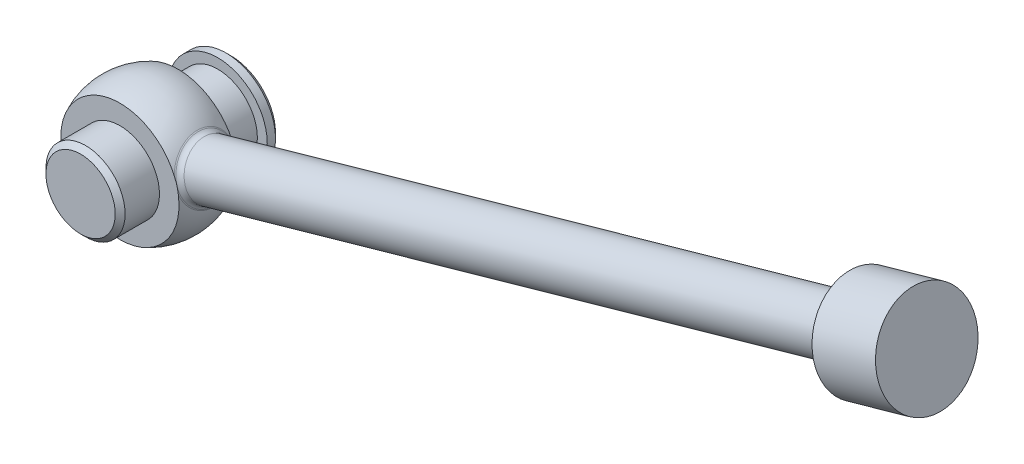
ISO-10303-21;
HEADER;
FILE_DESCRIPTION(('STEP AP214'),'2;1');
FILE_NAME('part.step','',(''),(''),'','','');
FILE_SCHEMA(('AUTOMOTIVE_DESIGN { 1 0 10303 214 1 1 1 1 }'));
ENDSEC;
DATA;
#1=APPLICATION_CONTEXT('core data for automotive mechanical design processes');
#2=APPLICATION_PROTOCOL_DEFINITION('international standard','automotive_design',2000,#1);
#3=PRODUCT_CONTEXT('',#1,'mechanical');
#4=PRODUCT('Part','Part','',(#3));
#5=PRODUCT_RELATED_PRODUCT_CATEGORY('part','',(#4));
#6=PRODUCT_DEFINITION_FORMATION('','',#4);
#7=PRODUCT_DEFINITION_CONTEXT('part definition',#1,'design');
#8=PRODUCT_DEFINITION('design','',#6,#7);
#9=PRODUCT_DEFINITION_SHAPE('','',#8);
#10=(LENGTH_UNIT() NAMED_UNIT(*) SI_UNIT(.MILLI.,.METRE.));
#11=(NAMED_UNIT(*) PLANE_ANGLE_UNIT() SI_UNIT($,.RADIAN.));
#12=(NAMED_UNIT(*) SI_UNIT($,.STERADIAN.) SOLID_ANGLE_UNIT());
#13=UNCERTAINTY_MEASURE_WITH_UNIT(LENGTH_MEASURE(1.E-05),#10,'distance_accuracy_value','');
#14=(GEOMETRIC_REPRESENTATION_CONTEXT(3) GLOBAL_UNCERTAINTY_ASSIGNED_CONTEXT((#13)) GLOBAL_UNIT_ASSIGNED_CONTEXT((#10,
#11,#12)) REPRESENTATION_CONTEXT('',''));
#15=CARTESIAN_POINT('',(0.,0.,0.));
#16=DIRECTION('',(0.,0.,1.));
#17=DIRECTION('',(1.,0.,0.));
#18=AXIS2_PLACEMENT_3D('',#15,#16,#17);
#19=CARTESIAN_POINT('',(142.33000616,-152.5466826,954.379375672));
#20=DIRECTION('',(0.,0.,-1.));
#21=DIRECTION('',(-1.,0.,0.));
#22=AXIS2_PLACEMENT_3D('',#19,#20,#21);
#23=PLANE('',#22);
#24=CARTESIAN_POINT('',(128.122796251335,143.089755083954,954.379375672));
#25=CARTESIAN_POINT('',(128.073408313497,142.728834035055,954.379375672));
#26=CARTESIAN_POINT('',(128.008803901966,142.369928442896,954.379375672));
#27=CARTESIAN_POINT('',(127.849594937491,141.658684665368,954.379375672));
#28=CARTESIAN_POINT('',(127.75497560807,141.306349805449,954.379375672));
#29=CARTESIAN_POINT('',(127.536206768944,140.610225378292,954.379375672));
#30=CARTESIAN_POINT('',(127.412001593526,140.266453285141,954.379375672));
#31=CARTESIAN_POINT('',(127.135042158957,139.590608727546,954.379375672));
#32=CARTESIAN_POINT('',(126.982287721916,139.258536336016,954.379375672));
#33=CARTESIAN_POINT('',(126.649460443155,138.608733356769,954.379375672));
#34=CARTESIAN_POINT('',(126.469411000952,138.29099078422,954.379375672));
#35=CARTESIAN_POINT('',(126.083173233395,137.671797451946,954.379375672));
#36=CARTESIAN_POINT('',(125.876984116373,137.370347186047,954.379375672));
#37=CARTESIAN_POINT('',(125.440044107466,136.786034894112,954.379375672));
#38=CARTESIAN_POINT('',(125.209305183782,136.50316391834,954.379375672));
#39=CARTESIAN_POINT('',(124.724824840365,135.957862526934,954.379375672));
#40=CARTESIAN_POINT('',(124.471083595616,135.695431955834,954.379375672));
#41=CARTESIAN_POINT('',(123.942348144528,135.192824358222,954.379375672));
#42=CARTESIAN_POINT('',(123.667349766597,134.952651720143,954.379375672));
#43=CARTESIAN_POINT('',(123.098098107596,134.496325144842,954.379375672));
#44=CARTESIAN_POINT('',(122.803844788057,134.280171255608,954.379375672));
#45=CARTESIAN_POINT('',(122.198149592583,133.873401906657,954.379375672));
#46=CARTESIAN_POINT('',(121.886706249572,133.682788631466,954.379375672));
#47=CARTESIAN_POINT('',(121.248868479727,133.328477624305,954.379375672));
#48=CARTESIAN_POINT('',(120.922474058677,133.164779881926,954.379375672));
#49=CARTESIAN_POINT('',(120.257067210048,132.865469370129,954.379375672));
#50=CARTESIAN_POINT('',(119.918055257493,132.729855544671,954.379375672));
#51=CARTESIAN_POINT('',(119.229811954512,132.487669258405,954.379375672));
#52=CARTESIAN_POINT('',(118.880580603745,132.381096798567,954.379375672));
#53=CARTESIAN_POINT('',(118.174385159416,132.197751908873,954.379375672));
#54=CARTESIAN_POINT('',(117.817421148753,132.120979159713,954.379375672));
#55=CARTESIAN_POINT('',(117.098294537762,131.997777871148,954.379375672));
#56=CARTESIAN_POINT('',(116.736131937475,131.951349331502,954.379375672));
#57=CARTESIAN_POINT('',(116.009180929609,131.88916637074,954.379375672));
#58=CARTESIAN_POINT('',(115.644392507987,131.873412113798,954.379375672));
#59=CARTESIAN_POINT('',(114.914785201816,131.872690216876,954.379375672));
#60=CARTESIAN_POINT('',(114.549966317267,131.887722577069,954.379375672));
#61=CARTESIAN_POINT('',(113.822891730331,131.948467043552,954.379375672));
#62=CARTESIAN_POINT('',(113.460636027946,131.994179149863,954.379375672));
#63=CARTESIAN_POINT('',(112.741263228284,132.115958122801,954.379375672));
#64=CARTESIAN_POINT('',(112.384146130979,132.192024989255,954.379375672));
#65=CARTESIAN_POINT('',(111.677591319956,132.37397220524,954.379375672));
#66=CARTESIAN_POINT('',(111.328153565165,132.479852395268,954.379375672));
#67=CARTESIAN_POINT('',(110.639439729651,132.72067368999,954.379375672));
#68=CARTESIAN_POINT('',(110.300163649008,132.855614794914,954.379375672));
#69=CARTESIAN_POINT('',(109.634181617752,133.153600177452,954.379375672));
#70=CARTESIAN_POINT('',(109.307475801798,133.316644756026,954.379375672));
#71=CARTESIAN_POINT('',(108.668960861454,133.669676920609,954.379375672));
#72=CARTESIAN_POINT('',(108.357151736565,133.85966450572,954.379375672));
#73=CARTESIAN_POINT('',(107.750635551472,134.265239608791,954.379375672));
#74=CARTESIAN_POINT('',(107.455929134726,134.480828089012,954.379375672));
#75=CARTESIAN_POINT('',(106.885726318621,134.936066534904,954.379375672));
#76=CARTESIAN_POINT('',(106.610229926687,135.175716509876,954.379375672));
#77=CARTESIAN_POINT('',(106.080428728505,135.677352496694,954.379375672));
#78=CARTESIAN_POINT('',(105.826122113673,135.939336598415,954.379375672));
#79=CARTESIAN_POINT('',(105.340482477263,136.483795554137,954.379375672));
#80=CARTESIAN_POINT('',(105.109149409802,136.766270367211,954.379375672));
#81=CARTESIAN_POINT('',(104.671143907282,137.349645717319,954.379375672));
#82=CARTESIAN_POINT('',(104.464466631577,137.650542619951,954.379375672));
#83=CARTESIAN_POINT('',(104.077187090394,138.268676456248,954.379375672));
#84=CARTESIAN_POINT('',(103.896585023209,138.585913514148,954.379375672));
#85=CARTESIAN_POINT('',(103.562660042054,139.234628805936,954.379375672));
#86=CARTESIAN_POINT('',(103.409350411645,139.566113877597,954.379375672));
#87=CARTESIAN_POINT('',(103.13121275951,140.24081334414,954.379375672));
#88=CARTESIAN_POINT('',(103.00638387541,140.584027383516,954.379375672));
#89=CARTESIAN_POINT('',(102.785995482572,141.280049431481,954.379375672));
#90=CARTESIAN_POINT('',(102.69046103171,141.632865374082,954.379375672));
#91=CARTESIAN_POINT('',(102.529487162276,142.345297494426,954.379375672));
#92=CARTESIAN_POINT('',(102.46404755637,142.704913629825,954.379375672));
#93=CARTESIAN_POINT('',(102.363822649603,143.42768881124,954.379375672));
#94=CARTESIAN_POINT('',(102.328979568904,143.790839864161,954.379375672));
#95=CARTESIAN_POINT('',(102.289997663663,144.518641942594,954.379375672));
#96=CARTESIAN_POINT('',(102.285843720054,144.883292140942,954.379375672));
#97=CARTESIAN_POINT('',(102.304023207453,145.475046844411,954.379375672));
#98=CARTESIAN_POINT('',(102.317012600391,145.702478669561,954.379375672));
#99=CARTESIAN_POINT('',(102.354938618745,146.156343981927,954.379375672));
#100=CARTESIAN_POINT('',(102.37987524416,146.382777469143,954.379375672));
#101=CARTESIAN_POINT('',(102.460158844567,146.9693426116,954.379375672));
#102=CARTESIAN_POINT('',(102.524774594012,147.328246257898,954.379375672));
#103=CARTESIAN_POINT('',(102.684006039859,148.039485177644,954.379375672));
#104=CARTESIAN_POINT('',(102.778636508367,148.391817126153,954.379375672));
#105=CARTESIAN_POINT('',(102.997427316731,149.087934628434,954.379375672));
#106=CARTESIAN_POINT('',(103.121643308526,149.431702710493,954.379375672));
#107=CARTESIAN_POINT('',(103.398623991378,150.107538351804,954.379375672));
#108=CARTESIAN_POINT('',(103.551388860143,150.439605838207,954.379375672));
#109=CARTESIAN_POINT('',(103.88423656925,151.089398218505,954.379375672));
#110=CARTESIAN_POINT('',(104.064296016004,151.407135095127,954.379375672));
#111=CARTESIAN_POINT('',(104.450553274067,152.026316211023,954.379375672));
#112=CARTESIAN_POINT('',(104.656751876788,152.327759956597,954.379375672));
#113=CARTESIAN_POINT('',(105.093710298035,152.912058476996,954.379375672));
#114=CARTESIAN_POINT('',(105.324458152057,153.194922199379,954.379375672));
#115=CARTESIAN_POINT('',(105.808955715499,153.740208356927,954.379375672));
#116=CARTESIAN_POINT('',(106.062705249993,154.002630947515,954.379375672));
#117=CARTESIAN_POINT('',(106.591456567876,154.50522189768,954.379375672));
#118=CARTESIAN_POINT('',(106.866462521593,154.745385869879,954.379375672));
#119=CARTESIAN_POINT('',(107.435728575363,155.201694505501,954.379375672));
#120=CARTESIAN_POINT('',(107.72998871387,155.41783912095,954.379375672));
#121=CARTESIAN_POINT('',(108.335696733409,155.824589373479,954.379375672));
#122=CARTESIAN_POINT('',(108.647146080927,156.015192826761,954.379375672));
#123=CARTESIAN_POINT('',(109.284995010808,156.369483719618,954.379375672));
#124=CARTESIAN_POINT('',(109.611394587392,156.533171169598,954.379375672));
#125=CARTESIAN_POINT('',(110.276810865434,156.832460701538,954.379375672));
#126=CARTESIAN_POINT('',(110.615827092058,156.968063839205,954.379375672));
#127=CARTESIAN_POINT('',(111.304078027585,157.210228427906,954.379375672));
#128=CARTESIAN_POINT('',(111.653312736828,157.316789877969,954.379375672));
#129=CARTESIAN_POINT('',(112.359513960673,157.50011250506,954.379375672));
#130=CARTESIAN_POINT('',(112.71648039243,157.576874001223,954.379375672));
#131=CARTESIAN_POINT('',(113.435610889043,157.700052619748,954.379375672));
#132=CARTESIAN_POINT('',(113.797774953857,157.746469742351,954.379375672));
#133=CARTESIAN_POINT('',(114.524727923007,157.808629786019,954.379375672));
#134=CARTESIAN_POINT('',(114.889516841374,157.824372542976,954.379375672));
#135=CARTESIAN_POINT('',(115.619124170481,157.825071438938,954.379375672));
#136=CARTESIAN_POINT('',(115.983942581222,157.810027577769,954.379375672));
#137=CARTESIAN_POINT('',(116.711015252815,157.749260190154,954.379375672));
#138=CARTESIAN_POINT('',(117.073269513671,157.703536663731,954.379375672));
#139=CARTESIAN_POINT('',(117.792638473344,157.581735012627,954.379375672));
#140=CARTESIAN_POINT('',(118.149753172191,157.505656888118,954.379375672));
#141=CARTESIAN_POINT('',(118.85630224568,157.32368739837,954.379375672));
#142=CARTESIAN_POINT('',(119.205736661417,157.217796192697,954.379375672));
#143=CARTESIAN_POINT('',(119.894442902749,156.976953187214,954.379375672));
#144=CARTESIAN_POINT('',(120.233714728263,156.842001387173,954.379375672));
#145=CARTESIAN_POINT('',(120.899687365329,156.543995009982,954.379375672));
#146=CARTESIAN_POINT('',(121.226388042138,156.380940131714,954.379375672));
#147=CARTESIAN_POINT('',(121.864891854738,156.027887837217,954.379375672));
#148=CARTESIAN_POINT('',(122.176694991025,155.837890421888,954.379375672));
#149=CARTESIAN_POINT('',(122.783198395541,155.432296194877,954.379375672));
#150=CARTESIAN_POINT('',(123.077898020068,155.216698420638,954.379375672));
#151=CARTESIAN_POINT('',(123.648086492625,154.76144199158,954.379375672));
#152=CARTESIAN_POINT('',(123.923575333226,154.521783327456,954.379375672));
#153=CARTESIAN_POINT('',(124.453360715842,154.020130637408,954.379375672));
#154=CARTESIAN_POINT('',(124.707659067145,153.758138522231,954.379375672));
#155=CARTESIAN_POINT('',(125.193281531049,153.213664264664,954.379375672));
#156=CARTESIAN_POINT('',(125.42460568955,152.931182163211,954.379375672));
#157=CARTESIAN_POINT('',(125.862592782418,152.347793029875,954.379375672));
#158=CARTESIAN_POINT('',(126.069260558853,152.046889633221,954.379375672));
#159=CARTESIAN_POINT('',(126.45652059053,151.428743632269,954.379375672));
#160=CARTESIAN_POINT('',(126.637112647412,151.111500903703,954.379375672));
#161=CARTESIAN_POINT('',(126.971017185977,150.462775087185,954.379375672));
#162=CARTESIAN_POINT('',(127.124316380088,150.131285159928,954.379375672));
#163=CARTESIAN_POINT('',(127.402432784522,149.456576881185,954.379375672));
#164=CARTESIAN_POINT('',(127.527250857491,149.113358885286,954.379375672));
#165=CARTESIAN_POINT('',(127.747617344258,148.4173297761,954.379375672));
#166=CARTESIAN_POINT('',(127.843140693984,148.064510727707,954.379375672));
#167=CARTESIAN_POINT('',(128.00409213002,147.352073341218,954.379375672));
#168=CARTESIAN_POINT('',(128.069520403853,146.992455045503,954.379375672));
#169=CARTESIAN_POINT('',(128.16972249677,146.269676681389,954.379375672));
#170=CARTESIAN_POINT('',(128.204554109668,145.906524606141,954.379375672));
#171=CARTESIAN_POINT('',(128.243513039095,145.178721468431,954.379375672));
#172=CARTESIAN_POINT('',(128.247655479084,144.814071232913,954.379375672));
#173=CARTESIAN_POINT('',(128.229461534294,144.222453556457,954.379375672));
#174=CARTESIAN_POINT('',(128.216476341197,143.995158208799,954.379375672));
#175=CARTESIAN_POINT('',(128.178573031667,143.541564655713,954.379375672));
#176=CARTESIAN_POINT('',(128.153654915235,143.315266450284,954.379375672));
#177=CARTESIAN_POINT('',(128.122796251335,143.089755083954,954.379375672));
#178=B_SPLINE_CURVE_WITH_KNOTS('',3,(#24,#25,#26,#27,#28,#29,#30,#31,#32,#33,#34,#35,#36,#37,
#38,#39,#40,#41,#42,#43,#44,#45,#46,#47,#48,#49,#50,#51,#52,#53,#54,#55,#56,#57,#58,#59,#60,#61,
#62,#63,#64,#65,#66,#67,#68,#69,#70,#71,#72,#73,#74,#75,#76,#77,#78,#79,#80,#81,#82,#83,#84,#85,
#86,#87,#88,#89,#90,#91,#92,#93,#94,#95,#96,#97,#98,#99,#100,#101,#102,#103,#104,#105,#106,#107,
#108,#109,#110,#111,#112,#113,#114,#115,#116,#117,#118,#119,#120,#121,#122,#123,#124,#125,#126,
#127,#128,#129,#130,#131,#132,#133,#134,#135,#136,#137,#138,#139,#140,#141,#142,#143,#144,#145,
#146,#147,#148,#149,#150,#151,#152,#153,#154,#155,#156,#157,#158,#159,#160,#161,#162,#163,#164,
#165,#166,#167,#168,#169,#170,#171,#172,#173,#174,#175,#176,#177),.UNSPECIFIED.,.T.,.F.,(4,2,2,
2,2,2,2,2,2,2,2,2,2,2,2,2,2,2,2,2,2,2,2,2,2,2,2,2,2,2,2,2,2,2,2,2,2,2,2,2,2,2,2,2,2,2,2,2,2,2,2,
2,2,2,2,2,2,2,2,2,2,2,2,2,2,2,2,2,2,2,2,2,2,2,2,2,4),(0.,1.09264502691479,2.18582880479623,
3.28108588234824,4.37634978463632,5.47067999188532,6.565043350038,7.65887562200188,
8.75269957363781,9.84673872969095,10.9407800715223,12.0349149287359,13.129049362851,
14.2231426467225,15.3172359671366,16.411317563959,17.5053991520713,18.5994865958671,
19.6935740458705,20.7876614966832,21.8817489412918,22.9758305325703,24.0699121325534,
25.1640054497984,26.2580987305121,27.3522331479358,28.4463679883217,29.5404093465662,
30.6344485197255,31.7282725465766,32.8221048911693,33.9164681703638,35.0107983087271,
36.1060619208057,37.2013187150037,38.2945027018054,39.3871480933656,40.0702655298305,
40.7533829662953,41.8460283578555,42.9392123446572,44.0344691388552,45.1297327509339,
46.2240628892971,47.3184261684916,48.4122585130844,49.5060825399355,50.6001217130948,
51.6941630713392,52.788297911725,53.8824323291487,54.9765256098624,56.0706189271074,
57.1647005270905,58.258782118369,59.3528695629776,60.4469570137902,61.5410444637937,
62.6351319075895,63.7292134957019,64.8232950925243,65.9173884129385,67.0114816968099,
68.105616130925,69.1997509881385,70.29379232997,71.3878314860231,72.481655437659,
73.5754877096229,74.6698510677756,75.7641812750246,76.8594451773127,77.9547022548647,
79.0478860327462,80.140531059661,80.8232395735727,81.5059480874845),.UNSPECIFIED.);
#179=CARTESIAN_POINT('',(126.946109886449,150.502647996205,954.379375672));
#180=VERTEX_POINT('',#179);
#181=CARTESIAN_POINT('',(128.175793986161,146.163820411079,954.379375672));
#182=VERTEX_POINT('',#181);
#183=EDGE_CURVE('E65',#180,#182,#178,.T.);
#184=ORIENTED_EDGE('',*,*,#183,.F.);
#185=CARTESIAN_POINT('',(110.456218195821,143.485514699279,954.379375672));
#186=DIRECTION('',(0.,0.,1.));
#187=DIRECTION('',(1.,0.,0.));
#188=AXIS2_PLACEMENT_3D('',#185,#186,#187);
#189=CIRCLE('',#188,17.9208450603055);
#190=EDGE_CURVE('E93',#180,#182,#189,.T.);
#191=ORIENTED_EDGE('',*,*,#190,.T.);
#192=EDGE_LOOP('',(#184,#191));
#193=FACE_BOUND('',#192,.T.);
#194=CARTESIAN_POINT('',(110.456218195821,143.485514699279,954.379375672));
#195=DIRECTION('',(0.,0.,1.));
#196=DIRECTION('',(1.,0.,0.));
#197=AXIS2_PLACEMENT_3D('',#194,#195,#196);
#198=CIRCLE('',#197,12.);
#199=CARTESIAN_POINT('',(122.456218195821,143.485514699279,954.379375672));
#200=VERTEX_POINT('',#199);
#201=EDGE_CURVE('E96',#200,#200,#198,.T.);
#202=ORIENTED_EDGE('',*,*,#201,.F.);
#203=EDGE_LOOP('',(#202));
#204=FACE_BOUND('',#203,.T.);
#205=ADVANCED_FACE('F39',(#193,#204),#23,.F.);
#206=CARTESIAN_POINT('',(154.071282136,-155.874323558,936.704162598));
#207=DIRECTION('',(0.,0.,-1.));
#208=DIRECTION('',(-1.,0.,0.));
#209=AXIS2_PLACEMENT_3D('',#206,#207,#208);
#210=PLANE('',#209);
#211=CARTESIAN_POINT('',(127.440733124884,149.501107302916,936.704162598));
#212=CARTESIAN_POINT('',(127.309924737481,149.843518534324,936.704162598));
#213=CARTESIAN_POINT('',(127.164601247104,150.180376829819,936.704162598));
#214=CARTESIAN_POINT('',(126.846121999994,150.840650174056,936.704162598));
#215=CARTESIAN_POINT('',(126.672967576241,151.164065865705,936.704162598));
#216=CARTESIAN_POINT('',(126.30014278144,151.794927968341,936.704162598));
#217=CARTESIAN_POINT('',(126.100491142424,152.102385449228,936.704162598));
#218=CARTESIAN_POINT('',(125.676010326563,152.699392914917,936.704162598));
#219=CARTESIAN_POINT('',(125.45118145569,152.988943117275,936.704162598));
#220=CARTESIAN_POINT('',(124.977826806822,153.548213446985,936.704162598));
#221=CARTESIAN_POINT('',(124.729289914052,153.817924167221,936.704162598));
#222=CARTESIAN_POINT('',(124.210376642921,154.33544740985,936.704162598));
#223=CARTESIAN_POINT('',(123.940000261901,154.583259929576,936.704162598));
#224=CARTESIAN_POINT('',(123.379384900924,155.05517865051,936.704162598));
#225=CARTESIAN_POINT('',(123.08914978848,155.27928944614,936.704162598));
#226=CARTESIAN_POINT('',(122.490834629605,155.70226586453,936.704162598));
#227=CARTESIAN_POINT('',(122.182754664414,155.901131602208,936.704162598));
#228=CARTESIAN_POINT('',(121.550930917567,156.272209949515,936.704162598));
#229=CARTESIAN_POINT('',(121.227186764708,156.44442192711,936.704162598));
#230=CARTESIAN_POINT('',(120.566342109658,156.760963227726,936.704162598));
#231=CARTESIAN_POINT('',(120.22924158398,156.905292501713,936.704162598));
#232=CARTESIAN_POINT('',(119.544029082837,157.165061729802,936.704162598));
#233=CARTESIAN_POINT('',(119.19591545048,157.280497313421,936.704162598));
#234=CARTESIAN_POINT('',(118.491200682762,157.481629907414,936.704162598));
#235=CARTESIAN_POINT('',(118.134599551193,157.567326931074,936.704162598));
#236=CARTESIAN_POINT('',(117.415461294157,157.708369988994,936.704162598));
#237=CARTESIAN_POINT('',(117.052924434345,157.763717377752,936.704162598));
#238=CARTESIAN_POINT('',(116.324476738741,157.843673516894,936.704162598));
#239=CARTESIAN_POINT('',(115.958565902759,157.868282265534,936.704162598));
#240=CARTESIAN_POINT('',(115.225994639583,157.886585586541,936.704162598));
#241=CARTESIAN_POINT('',(114.859334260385,157.880282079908,936.704162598));
#242=CARTESIAN_POINT('',(114.127847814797,157.836810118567,936.704162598));
#243=CARTESIAN_POINT('',(113.763021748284,157.799641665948,936.704162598));
#244=CARTESIAN_POINT('',(113.037789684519,157.694702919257,936.704162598));
#245=CARTESIAN_POINT('',(112.677383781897,157.626931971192,936.704162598));
#246=CARTESIAN_POINT('',(111.963562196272,157.461269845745,936.704162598));
#247=CARTESIAN_POINT('',(111.610146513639,157.363378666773,936.704162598));
#248=CARTESIAN_POINT('',(110.91281113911,157.138169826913,936.704162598));
#249=CARTESIAN_POINT('',(110.568891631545,157.01085159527,936.704162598));
#250=CARTESIAN_POINT('',(109.893000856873,156.727694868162,936.704162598));
#251=CARTESIAN_POINT('',(109.561029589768,156.571856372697,936.704162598));
#252=CARTESIAN_POINT('',(108.911397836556,156.232768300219,936.704162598));
#253=CARTESIAN_POINT('',(108.593737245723,156.049518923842,936.704162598));
#254=CARTESIAN_POINT('',(107.9749826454,155.656911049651,936.704162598));
#255=CARTESIAN_POINT('',(107.673888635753,155.447552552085,936.704162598));
#256=CARTESIAN_POINT('',(107.090409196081,155.004215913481,936.704162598));
#257=CARTESIAN_POINT('',(106.808023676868,154.770237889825,936.704162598));
#258=CARTESIAN_POINT('',(106.263967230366,154.279324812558,936.704162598));
#259=CARTESIAN_POINT('',(106.00229630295,154.022389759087,936.704162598));
#260=CARTESIAN_POINT('',(105.501530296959,153.487390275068,936.704162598));
#261=CARTESIAN_POINT('',(105.262435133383,153.209325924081,936.704162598));
#262=CARTESIAN_POINT('',(104.808519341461,152.634043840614,936.704162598));
#263=CARTESIAN_POINT('',(104.593698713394,152.336826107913,936.704162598));
#264=CARTESIAN_POINT('',(104.189856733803,151.725346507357,936.704162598));
#265=CARTESIAN_POINT('',(104.000835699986,151.411084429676,936.704162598));
#266=CARTESIAN_POINT('',(103.649939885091,150.767753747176,936.704162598));
#267=CARTESIAN_POINT('',(103.488065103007,150.438685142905,936.704162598));
#268=CARTESIAN_POINT('',(103.192606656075,149.768067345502,936.704162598));
#269=CARTESIAN_POINT('',(103.059024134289,149.426517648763,936.704162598));
#270=CARTESIAN_POINT('',(102.821108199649,148.733378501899,936.704162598));
#271=CARTESIAN_POINT('',(102.716774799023,148.381789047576,936.704162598));
#272=CARTESIAN_POINT('',(102.538107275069,147.671103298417,936.704162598));
#273=CARTESIAN_POINT('',(102.463770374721,147.312007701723,936.704162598));
#274=CARTESIAN_POINT('',(102.345610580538,146.588831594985,936.704162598));
#275=CARTESIAN_POINT('',(102.301787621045,146.224751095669,936.704162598));
#276=CARTESIAN_POINT('',(102.244972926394,145.494269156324,936.704162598));
#277=CARTESIAN_POINT('',(102.231974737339,145.127868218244,936.704162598));
#278=CARTESIAN_POINT('',(102.236883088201,144.395270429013,936.704162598));
#279=CARTESIAN_POINT('',(102.254789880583,144.029073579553,936.704162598));
#280=CARTESIAN_POINT('',(102.321398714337,143.299299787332,936.704162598));
#281=CARTESIAN_POINT('',(102.370116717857,142.935724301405,936.704162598));
#282=CARTESIAN_POINT('',(102.498014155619,142.213983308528,936.704162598));
#283=CARTESIAN_POINT('',(102.57719260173,141.855817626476,936.704162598));
#284=CARTESIAN_POINT('',(102.765532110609,141.147113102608,936.704162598));
#285=CARTESIAN_POINT('',(102.874720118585,140.796581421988,936.704162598));
#286=CARTESIAN_POINT('',(103.122271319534,140.105975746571,936.704162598));
#287=CARTESIAN_POINT('',(103.260634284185,139.765901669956,936.704162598));
#288=CARTESIAN_POINT('',(103.565235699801,139.099311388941,936.704162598));
#289=CARTESIAN_POINT('',(103.731417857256,138.772769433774,936.704162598));
#290=CARTESIAN_POINT('',(104.090609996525,138.134964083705,936.704162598));
#291=CARTESIAN_POINT('',(104.283605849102,137.823692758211,936.704162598));
#292=CARTESIAN_POINT('',(104.599399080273,137.359225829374,936.704162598));
#293=CARTESIAN_POINT('',(104.713134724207,137.199797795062,936.704162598));
#294=CARTESIAN_POINT('',(104.947671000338,136.886226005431,936.704162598));
#295=CARTESIAN_POINT('',(105.06847163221,136.732082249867,936.704162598));
#296=CARTESIAN_POINT('',(105.424821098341,136.297906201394,936.704162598));
#297=CARTESIAN_POINT('',(105.668910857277,136.024807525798,936.704162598));
#298=CARTESIAN_POINT('',(106.179258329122,135.500059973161,936.704162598));
#299=CARTESIAN_POINT('',(106.445523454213,135.248418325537,936.704162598));
#300=CARTESIAN_POINT('',(106.998765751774,134.768019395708,936.704162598));
#301=CARTESIAN_POINT('',(107.285777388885,134.539301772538,936.704162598));
#302=CARTESIAN_POINT('',(107.878296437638,134.106705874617,936.704162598));
#303=CARTESIAN_POINT('',(108.183818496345,133.902847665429,936.704162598));
#304=CARTESIAN_POINT('',(108.810414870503,133.521974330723,936.704162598));
#305=CARTESIAN_POINT('',(109.131460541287,133.344912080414,936.704162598));
#306=CARTESIAN_POINT('',(109.787472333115,133.018381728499,936.704162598));
#307=CARTESIAN_POINT('',(110.12244469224,132.8689261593,936.704162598));
#308=CARTESIAN_POINT('',(110.803805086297,132.598765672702,936.704162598));
#309=CARTESIAN_POINT('',(111.150193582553,132.478061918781,936.704162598));
#310=CARTESIAN_POINT('',(111.85175090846,132.26631925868,936.704162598));
#311=CARTESIAN_POINT('',(112.206915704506,132.17526698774,936.704162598));
#312=CARTESIAN_POINT('',(112.923881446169,132.023351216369,936.704162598));
#313=CARTESIAN_POINT('',(113.285686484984,131.962507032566,936.704162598));
#314=CARTESIAN_POINT('',(114.012785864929,131.871571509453,936.704162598));
#315=CARTESIAN_POINT('',(114.378076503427,131.84145056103,936.704162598));
#316=CARTESIAN_POINT('',(115.11006731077,131.812065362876,936.704162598));
#317=CARTESIAN_POINT('',(115.476768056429,131.81281547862,936.704162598));
#318=CARTESIAN_POINT('',(116.208887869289,131.845206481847,936.704162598));
#319=CARTESIAN_POINT('',(116.574306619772,131.876854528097,936.704162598));
#320=CARTESIAN_POINT('',(117.301123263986,131.970819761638,936.704162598));
#321=CARTESIAN_POINT('',(117.662521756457,132.033132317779,936.704162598));
#322=CARTESIAN_POINT('',(118.378784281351,132.187981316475,936.704162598));
#323=CARTESIAN_POINT('',(118.733648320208,132.280517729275,936.704162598));
#324=CARTESIAN_POINT('',(119.434307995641,132.495153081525,936.704162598));
#325=CARTESIAN_POINT('',(119.78010392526,132.617251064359,936.704162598));
#326=CARTESIAN_POINT('',(120.46018488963,132.890144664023,936.704162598));
#327=CARTESIAN_POINT('',(120.794469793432,133.04094060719,936.704162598));
#328=CARTESIAN_POINT('',(121.44914435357,133.370155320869,936.704162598));
#329=CARTESIAN_POINT('',(121.769534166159,133.548573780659,936.704162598));
#330=CARTESIAN_POINT('',(122.394144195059,133.93176595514,936.704162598));
#331=CARTESIAN_POINT('',(122.698364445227,134.136539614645,936.704162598));
#332=CARTESIAN_POINT('',(123.288485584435,134.570995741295,936.704162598));
#333=CARTESIAN_POINT('',(123.574385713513,134.800679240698,936.704162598));
#334=CARTESIAN_POINT('',(124.125820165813,135.283315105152,936.704162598));
#335=CARTESIAN_POINT('',(124.391354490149,135.536267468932,936.704162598));
#336=CARTESIAN_POINT('',(124.900172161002,136.063645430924,936.704162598));
#337=CARTESIAN_POINT('',(125.143455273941,136.338071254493,936.704162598));
#338=CARTESIAN_POINT('',(125.606038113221,136.906443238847,936.704162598));
#339=CARTESIAN_POINT('',(125.825337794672,137.200389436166,936.704162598));
#340=CARTESIAN_POINT('',(126.238381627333,137.805693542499,936.704162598));
#341=CARTESIAN_POINT('',(126.432127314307,138.117050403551,936.704162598));
#342=CARTESIAN_POINT('',(126.792699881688,138.754976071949,936.704162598));
#343=CARTESIAN_POINT('',(126.959526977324,139.081544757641,936.704162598));
#344=CARTESIAN_POINT('',(127.265090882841,139.74760192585,936.704162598));
#345=CARTESIAN_POINT('',(127.403825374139,140.087091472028,936.704162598));
#346=CARTESIAN_POINT('',(127.652204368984,140.776563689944,936.704162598));
#347=CARTESIAN_POINT('',(127.761847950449,141.126546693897,936.704162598));
#348=CARTESIAN_POINT('',(127.95125197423,141.834472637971,936.704162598));
#349=CARTESIAN_POINT('',(128.031014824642,142.192414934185,936.704162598));
#350=CARTESIAN_POINT('',(128.16009534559,142.913719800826,936.704162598));
#351=CARTESIAN_POINT('',(128.209416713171,143.277081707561,936.704162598));
#352=CARTESIAN_POINT('',(128.271531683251,143.944836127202,936.704162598));
#353=CARTESIAN_POINT('',(128.289096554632,144.248794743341,936.704162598));
#354=CARTESIAN_POINT('',(128.302911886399,144.857169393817,936.704162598));
#355=CARTESIAN_POINT('',(128.299165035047,145.16158536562,936.704162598));
#356=CARTESIAN_POINT('',(128.270382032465,145.769213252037,936.704162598));
#357=CARTESIAN_POINT('',(128.245359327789,146.072425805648,936.704162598));
#358=CARTESIAN_POINT('',(128.17418213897,146.676405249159,936.704162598));
#359=CARTESIAN_POINT('',(128.12802455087,146.977171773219,936.704162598));
#360=CARTESIAN_POINT('',(128.0713730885,147.275953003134,936.704162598));
#361=B_SPLINE_CURVE_WITH_KNOTS('',3,(#211,#212,#213,#214,#215,#216,#217,#218,#219,#220,#221,
#222,#223,#224,#225,#226,#227,#228,#229,#230,#231,#232,#233,#234,#235,#236,#237,#238,#239,#240,
#241,#242,#243,#244,#245,#246,#247,#248,#249,#250,#251,#252,#253,#254,#255,#256,#257,#258,#259,
#260,#261,#262,#263,#264,#265,#266,#267,#268,#269,#270,#271,#272,#273,#274,#275,#276,#277,#278,
#279,#280,#281,#282,#283,#284,#285,#286,#287,#288,#289,#290,#291,#292,#293,#294,#295,#296,#297,
#298,#299,#300,#301,#302,#303,#304,#305,#306,#307,#308,#309,#310,#311,#312,#313,#314,#315,#316,
#317,#318,#319,#320,#321,#322,#323,#324,#325,#326,#327,#328,#329,#330,#331,#332,#333,#334,#335,
#336,#337,#338,#339,#340,#341,#342,#343,#344,#345,#346,#347,#348,#349,#350,#351,#352,#353,#354,
#355,#356,#357,#358,#359,#360),.UNSPECIFIED.,.F.,.F.,(4,2,2,2,2,2,2,2,2,2,2,2,2,2,2,2,2,2,2,2,2,
2,2,2,2,2,2,2,2,2,2,2,2,2,2,2,2,2,2,2,2,2,2,2,2,2,2,2,2,2,2,2,2,2,2,2,2,2,2,2,2,2,2,2,2,2,2,2,2,
2,2,2,2,2,4),(0.,1.09930364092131,2.19855464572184,3.29703264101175,4.39549728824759,
5.49447947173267,6.59346178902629,7.69223068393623,8.79099457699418,9.889784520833,
10.9885763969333,12.0875343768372,13.1864918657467,14.2854003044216,15.3843088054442,
16.4831490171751,17.581989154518,18.6808527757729,19.7797164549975,20.8786014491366,
21.9774864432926,23.0763633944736,24.175240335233,25.2741120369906,26.3729837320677,
27.4718512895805,28.5707188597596,29.6695999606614,30.7684810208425,31.8674064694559,
32.9663323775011,34.0651565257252,35.1639783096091,36.2625700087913,37.3611706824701,
38.4603409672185,39.5594755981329,40.6596003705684,41.7597165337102,42.857632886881,
43.954972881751,44.5423160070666,45.129659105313,46.2271029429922,47.3249150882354,
48.4245948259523,49.5251563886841,50.6237593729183,51.7228598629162,52.8220048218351,
53.9206536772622,55.0200041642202,56.1182941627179,57.217095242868,58.3161509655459,
59.4150407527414,60.5139294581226,61.612782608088,62.7116482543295,63.8105015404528,
64.9093525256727,66.008249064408,67.1071455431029,68.2060535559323,69.3049636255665,
70.4038076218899,71.5026428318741,72.6015686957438,73.7005293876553,74.7994014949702,
75.898140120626,76.8108184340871,77.7233816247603,78.6353684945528,79.547489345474),.UNSPECIFIED.);
#362=CARTESIAN_POINT('',(128.259389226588,145.868862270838,936.704162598));
#363=VERTEX_POINT('',#362);
#364=CARTESIAN_POINT('',(128.071373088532,147.27595300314,936.704162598));
#365=VERTEX_POINT('',#364);
#366=EDGE_CURVE('E78',#363,#365,#361,.T.);
#367=ORIENTED_EDGE('',*,*,#366,.F.);
#368=CARTESIAN_POINT('',(110.456218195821,143.485514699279,936.704162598));
#369=DIRECTION('',(0.,0.,1.));
#370=DIRECTION('',(1.,0.,0.));
#371=AXIS2_PLACEMENT_3D('',#368,#369,#370);
#372=CIRCLE('',#371,17.961994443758);
#373=CARTESIAN_POINT('',(126.862514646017,150.797606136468,936.704162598));
#374=VERTEX_POINT('',#373);
#375=EDGE_CURVE('E82',#374,#363,#372,.T.);
#376=ORIENTED_EDGE('',*,*,#375,.F.);
#377=CARTESIAN_POINT('',(127.440732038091,149.501110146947,936.704162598));
#378=VERTEX_POINT('',#377);
#379=EDGE_CURVE('E59',#378,#374,#361,.T.);
#380=ORIENTED_EDGE('',*,*,#379,.F.);
#381=CARTESIAN_POINT('',(127.440733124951,149.501107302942,936.704162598));
#382=CARTESIAN_POINT('',(127.475256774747,149.410798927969,936.704162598));
#383=CARTESIAN_POINT('',(127.50897632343,149.320177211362,936.704162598));
#384=CARTESIAN_POINT('',(127.574509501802,149.138407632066,936.704162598));
#385=CARTESIAN_POINT('',(127.606326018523,149.047260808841,936.704162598));
#386=CARTESIAN_POINT('',(127.667829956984,148.864363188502,936.704162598));
#387=CARTESIAN_POINT('',(127.697519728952,148.772613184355,936.704162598));
#388=CARTESIAN_POINT('',(127.754640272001,148.588468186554,936.704162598));
#389=CARTESIAN_POINT('',(127.78207229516,148.496073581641,936.704162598));
#390=CARTESIAN_POINT('',(127.834629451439,148.310630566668,936.704162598));
#391=CARTESIAN_POINT('',(127.859754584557,148.217582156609,936.704162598));
#392=CARTESIAN_POINT('',(127.907745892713,148.030849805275,936.704162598));
#393=CARTESIAN_POINT('',(127.930610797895,147.93716553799,936.704162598));
#394=CARTESIAN_POINT('',(127.974216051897,147.749195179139,936.704162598));
#395=CARTESIAN_POINT('',(127.994953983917,147.654908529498,936.704162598));
#396=CARTESIAN_POINT('',(128.034537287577,147.465784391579,936.704162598));
#397=CARTESIAN_POINT('',(128.053379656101,147.370946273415,936.704162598));
#398=CARTESIAN_POINT('',(128.071373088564,147.275953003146,936.704162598));
#399=B_SPLINE_CURVE_WITH_KNOTS('',3,(#381,#382,#383,#384,#385,#386,#387,#388,#389,#390,#391,
#392,#393,#394,#395,#396,#397,#398),.UNSPECIFIED.,.F.,.F.,(4,2,2,2,2,2,2,2,4),(0.,
0.290051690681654,0.579651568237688,0.86892631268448,1.15803953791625,1.44715276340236,
1.73642750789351,2.02602738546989,2.31607907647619),.UNSPECIFIED.);
#400=EDGE_CURVE('E84',#378,#365,#399,.T.);
#401=ORIENTED_EDGE('',*,*,#400,.T.);
#402=EDGE_LOOP('',(#367,#376,#380,#401));
#403=FACE_BOUND('',#402,.T.);
#404=CARTESIAN_POINT('',(110.456218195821,143.485514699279,936.704162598));
#405=DIRECTION('',(0.,0.,1.));
#406=DIRECTION('',(1.,0.,0.));
#407=AXIS2_PLACEMENT_3D('',#404,#405,#406);
#408=CIRCLE('',#407,12.);
#409=CARTESIAN_POINT('',(122.456218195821,143.485514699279,936.704162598));
#410=VERTEX_POINT('',#409);
#411=EDGE_CURVE('E94',#410,#410,#408,.T.);
#412=ORIENTED_EDGE('',*,*,#411,.T.);
#413=EDGE_LOOP('',(#412));
#414=FACE_BOUND('',#413,.T.);
#415=ADVANCED_FACE('F79',(#403,#414),#210,.T.);
#416=CARTESIAN_POINT('',(115.266750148,144.848886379,945.5));
#417=DIRECTION('',(-0.239294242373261,0.844327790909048,0.479425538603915));
#418=DIRECTION('',(0.130727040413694,-0.461258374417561,0.87758256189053));
#419=AXIS2_PLACEMENT_3D('',#416,#417,#418);
#420=SPHERICAL_SURFACE('',#419,15.7230969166);
#421=CARTESIAN_POINT('',(128.259389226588,145.86886227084,936.704162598));
#422=CARTESIAN_POINT('',(128.326847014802,145.630843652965,936.776177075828));
#423=CARTESIAN_POINT('',(128.393470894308,145.395767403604,936.858679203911));
#424=CARTESIAN_POINT('',(128.524585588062,144.933141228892,937.043953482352));
#425=CARTESIAN_POINT('',(128.589076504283,144.705590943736,937.146724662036));
#426=CARTESIAN_POINT('',(128.715422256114,144.259791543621,937.371759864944));
#427=CARTESIAN_POINT('',(128.777278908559,144.041536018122,937.49401016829));
#428=CARTESIAN_POINT('',(128.897964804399,143.615706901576,937.757176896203));
#429=CARTESIAN_POINT('',(128.956794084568,143.408133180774,937.898093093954));
#430=CARTESIAN_POINT('',(129.07103435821,143.005046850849,938.19766331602));
#431=CARTESIAN_POINT('',(129.126443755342,142.809539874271,938.356325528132));
#432=CARTESIAN_POINT('',(129.233421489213,142.432078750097,938.690208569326));
#433=CARTESIAN_POINT('',(129.284989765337,142.25012481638,938.865429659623));
#434=CARTESIAN_POINT('',(129.383907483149,141.901102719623,939.231145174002));
#435=CARTESIAN_POINT('',(129.431257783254,141.734031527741,939.421636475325));
#436=CARTESIAN_POINT('',(129.521414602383,141.415921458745,939.816568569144));
#437=CARTESIAN_POINT('',(129.564221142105,141.264882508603,940.02100929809));
#438=CARTESIAN_POINT('',(129.64498034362,140.979931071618,940.4423561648));
#439=CARTESIAN_POINT('',(129.682933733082,140.846016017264,940.659260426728));
#440=CARTESIAN_POINT('',(129.75373674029,140.596194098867,941.104098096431));
#441=CARTESIAN_POINT('',(129.786584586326,140.480293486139,941.332035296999));
#442=CARTESIAN_POINT('',(129.84692631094,140.267383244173,941.797242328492));
#443=CARTESIAN_POINT('',(129.874420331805,140.170373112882,942.03451191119));
#444=CARTESIAN_POINT('',(129.923860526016,139.995927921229,942.516707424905));
#445=CARTESIAN_POINT('',(129.945806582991,139.918493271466,942.761633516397));
#446=CARTESIAN_POINT('',(129.983992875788,139.78375643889,943.25738052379));
#447=CARTESIAN_POINT('',(130.000233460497,139.726453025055,943.508201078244));
#448=CARTESIAN_POINT('',(130.026895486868,139.63237850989,944.013973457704));
#449=CARTESIAN_POINT('',(130.03731680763,139.595607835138,944.268925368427));
#450=CARTESIAN_POINT('',(130.052265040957,139.54286436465,944.781120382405));
#451=CARTESIAN_POINT('',(130.056792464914,139.526889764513,945.038363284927));
#452=CARTESIAN_POINT('',(130.059922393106,139.515846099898,945.553333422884));
#453=CARTESIAN_POINT('',(130.058524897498,139.520777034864,945.811060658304));
#454=CARTESIAN_POINT('',(130.049814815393,139.5515097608,946.325173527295));
#455=CARTESIAN_POINT('',(130.042502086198,139.57731205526,946.581559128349));
#456=CARTESIAN_POINT('',(130.022013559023,139.649603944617,947.091154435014));
#457=CARTESIAN_POINT('',(130.008837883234,139.696093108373,947.3443642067));
#458=CARTESIAN_POINT('',(129.976716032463,139.809432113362,947.845830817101));
#459=CARTESIAN_POINT('',(129.957769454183,139.876283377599,948.094087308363));
#460=CARTESIAN_POINT('',(129.914241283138,140.029868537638,948.583858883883));
#461=CARTESIAN_POINT('',(129.889659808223,140.116602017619,948.82537410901));
#462=CARTESIAN_POINT('',(129.83503182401,140.309351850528,949.299991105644));
#463=CARTESIAN_POINT('',(129.80498440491,140.415371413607,949.533091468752));
#464=CARTESIAN_POINT('',(129.739652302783,140.6458897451,949.989099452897));
#465=CARTESIAN_POINT('',(129.704369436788,140.770382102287,950.212010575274));
#466=CARTESIAN_POINT('',(129.628803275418,141.037010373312,950.64617761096));
#467=CARTESIAN_POINT('',(129.588519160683,141.179149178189,950.857431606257));
#468=CARTESIAN_POINT('',(129.503242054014,141.480041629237,951.266740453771));
#469=CARTESIAN_POINT('',(129.458249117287,141.638795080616,951.46479546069));
#470=CARTESIAN_POINT('',(129.363865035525,141.971820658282,951.846335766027));
#471=CARTESIAN_POINT('',(129.31447310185,142.146095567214,952.029818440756));
#472=CARTESIAN_POINT('',(129.211650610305,142.508895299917,952.380867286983));
#473=CARTESIAN_POINT('',(129.158220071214,142.697420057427,952.548433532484));
#474=CARTESIAN_POINT('',(129.047708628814,143.087349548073,952.866427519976));
#475=CARTESIAN_POINT('',(128.990628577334,143.288751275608,953.016859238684));
#476=CARTESIAN_POINT('',(128.873239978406,143.702946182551,953.299512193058));
#477=CARTESIAN_POINT('',(128.812932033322,143.915737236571,953.431736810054));
#478=CARTESIAN_POINT('',(128.660387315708,144.453977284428,953.734897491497));
#479=CARTESIAN_POINT('',(128.566481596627,144.785315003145,953.894765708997));
#480=CARTESIAN_POINT('',(128.422252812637,145.294213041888,954.101518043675));
#481=CARTESIAN_POINT('',(128.373634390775,145.465758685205,954.164908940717));
#482=CARTESIAN_POINT('',(128.275411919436,145.812327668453,954.280548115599));
#483=CARTESIAN_POINT('',(128.225807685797,145.987351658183,954.332794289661));
#484=CARTESIAN_POINT('',(128.175793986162,146.163820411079,954.379375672));
#485=B_SPLINE_CURVE_WITH_KNOTS('',3,(#421,#422,#423,#424,#425,#426,#427,#428,#429,#430,#431,
#432,#433,#434,#435,#436,#437,#438,#439,#440,#441,#442,#443,#444,#445,#446,#447,#448,#449,#450,
#451,#452,#453,#454,#455,#456,#457,#458,#459,#460,#461,#462,#463,#464,#465,#466,#467,#468,#469,
#470,#471,#472,#473,#474,#475,#476,#477,#478,#479,#480,#481,#482,#483,#484),.UNSPECIFIED.,.F.,
.F.,(4,2,2,2,2,2,2,2,2,2,2,2,2,2,2,2,2,2,2,2,2,2,2,2,2,2,2,2,2,2,2,4),(0.,0.772748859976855,
1.54546072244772,2.31763072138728,3.08979133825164,3.86230970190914,4.63484025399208,
5.40721322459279,6.17958267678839,6.95183618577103,7.72435708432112,8.49685744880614,
9.26937401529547,10.0418433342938,10.8143287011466,11.5867470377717,12.3591653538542,
13.1316023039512,13.9040231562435,14.6764980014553,15.4489566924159,16.2215440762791,
16.9938639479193,17.7663105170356,18.5387480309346,19.3113243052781,20.083896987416,
20.8562899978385,21.6285393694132,22.7642310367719,23.331636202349,23.8991483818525),.UNSPECIFIED.);
#486=EDGE_CURVE('E12',#363,#182,#485,.T.);
#487=ORIENTED_EDGE('',*,*,#486,.F.);
#488=ORIENTED_EDGE('',*,*,#366,.T.);
#489=CARTESIAN_POINT('',(127.756052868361,148.38852852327,945.5));
#490=DIRECTION('',(0.962106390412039,0.272674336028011,1.90555904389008E-13));
#491=DIRECTION('',(0.27267433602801,-0.962106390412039,-1.50173394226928E-13));
#492=AXIS2_PLACEMENT_3D('',#489,#490,#491);
#493=CIRCLE('',#492,8.87152905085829);
#494=EDGE_CURVE('E132',#365,#378,#493,.F.);
#495=ORIENTED_EDGE('',*,*,#494,.T.);
#496=ORIENTED_EDGE('',*,*,#379,.T.);
#497=CARTESIAN_POINT('',(126.946109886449,150.502647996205,954.379375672));
#498=CARTESIAN_POINT('',(126.878011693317,150.742926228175,954.315983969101));
#499=CARTESIAN_POINT('',(126.810647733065,150.98061378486,954.242004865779));
#500=CARTESIAN_POINT('',(126.677859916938,151.449143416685,954.073517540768));
#501=CARTESIAN_POINT('',(126.61243596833,151.679985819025,953.979010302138));
#502=CARTESIAN_POINT('',(126.48403823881,152.133025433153,953.770179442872));
#503=CARTESIAN_POINT('',(126.421062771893,152.355228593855,953.65586976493));
#504=CARTESIAN_POINT('',(126.297960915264,152.78958220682,953.408210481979));
#505=CARTESIAN_POINT('',(126.237834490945,153.001732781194,953.274861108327));
#506=CARTESIAN_POINT('',(126.120830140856,153.414571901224,952.990000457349));
#507=CARTESIAN_POINT('',(126.063953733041,153.615255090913,952.838480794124));
#508=CARTESIAN_POINT('',(125.953883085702,154.003629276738,952.518404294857));
#509=CARTESIAN_POINT('',(125.900688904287,154.19132006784,952.349847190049));
#510=CARTESIAN_POINT('',(125.798372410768,154.552334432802,951.996932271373));
#511=CARTESIAN_POINT('',(125.749249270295,154.725660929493,951.812577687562));
#512=CARTESIAN_POINT('',(125.655412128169,155.05675668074,951.429349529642));
#513=CARTESIAN_POINT('',(125.610698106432,155.214526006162,951.230476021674));
#514=CARTESIAN_POINT('',(125.526003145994,155.51336440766,950.819653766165));
#515=CARTESIAN_POINT('',(125.4860214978,155.654435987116,950.607706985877));
#516=CARTESIAN_POINT('',(125.411054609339,155.918949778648,950.172141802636));
#517=CARTESIAN_POINT('',(125.37607110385,156.042385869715,949.94851938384));
#518=CARTESIAN_POINT('',(125.311366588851,156.270689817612,949.491266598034));
#519=CARTESIAN_POINT('',(125.281645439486,156.37555816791,949.257636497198));
#520=CARTESIAN_POINT('',(125.227675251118,156.565987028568,948.782018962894));
#521=CARTESIAN_POINT('',(125.203426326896,156.65154713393,948.540031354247));
#522=CARTESIAN_POINT('',(125.160575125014,156.802743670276,948.049439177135));
#523=CARTESIAN_POINT('',(125.141972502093,156.868381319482,947.800835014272));
#524=CARTESIAN_POINT('',(125.110543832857,156.979274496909,947.298757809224));
#525=CARTESIAN_POINT('',(125.097717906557,157.024529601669,947.045284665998));
#526=CARTESIAN_POINT('',(125.077935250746,157.09433088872,946.535298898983));
#527=CARTESIAN_POINT('',(125.070978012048,157.11887886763,946.278786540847));
#528=CARTESIAN_POINT('',(125.062980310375,157.147098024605,945.764524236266));
#529=CARTESIAN_POINT('',(125.061939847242,157.150769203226,945.506774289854));
#530=CARTESIAN_POINT('',(125.065783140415,157.13720849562,944.991862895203));
#531=CARTESIAN_POINT('',(125.070667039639,157.11997610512,944.73470146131));
#532=CARTESIAN_POINT('',(125.086324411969,157.064730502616,944.222806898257));
#533=CARTESIAN_POINT('',(125.097097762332,157.026717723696,943.968073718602));
#534=CARTESIAN_POINT('',(125.124458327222,156.9301784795,943.462823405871));
#535=CARTESIAN_POINT('',(125.141045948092,156.871650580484,943.212306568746));
#536=CARTESIAN_POINT('',(125.179916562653,156.734499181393,942.717293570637));
#537=CARTESIAN_POINT('',(125.202199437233,156.65587610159,942.472797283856));
#538=CARTESIAN_POINT('',(125.252306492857,156.479077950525,941.991518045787));
#539=CARTESIAN_POINT('',(125.280131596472,156.380899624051,941.75473638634));
#540=CARTESIAN_POINT('',(125.341112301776,156.165734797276,941.290693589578));
#541=CARTESIAN_POINT('',(125.374266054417,156.048754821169,941.063429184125));
#542=CARTESIAN_POINT('',(125.445681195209,155.796773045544,940.619912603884));
#543=CARTESIAN_POINT('',(125.483943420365,155.661768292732,940.403662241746));
#544=CARTESIAN_POINT('',(125.565298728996,155.37471354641,939.983753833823));
#545=CARTESIAN_POINT('',(125.608391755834,155.222663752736,939.780095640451));
#546=CARTESIAN_POINT('',(125.6991111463,154.902568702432,939.386780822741));
#547=CARTESIAN_POINT('',(125.746738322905,154.73452057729,939.197126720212));
#548=CARTESIAN_POINT('',(125.846179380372,154.383651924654,938.833211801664));
#549=CARTESIAN_POINT('',(125.897993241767,154.200831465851,938.658950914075));
#550=CARTESIAN_POINT('',(126.005431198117,153.821746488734,938.327093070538));
#551=CARTESIAN_POINT('',(126.061054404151,153.625485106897,938.169492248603));
#552=CARTESIAN_POINT('',(126.175699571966,153.220970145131,937.872079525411));
#553=CARTESIAN_POINT('',(126.23472089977,153.012718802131,937.732264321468));
#554=CARTESIAN_POINT('',(126.38430711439,152.484917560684,937.409884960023));
#555=CARTESIAN_POINT('',(126.476644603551,152.159113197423,937.238169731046));
#556=CARTESIAN_POINT('',(126.618831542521,151.657419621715,937.013198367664));
#557=CARTESIAN_POINT('',(126.666821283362,151.4880922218,936.943662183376));
#558=CARTESIAN_POINT('',(126.763891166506,151.14559004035,936.815600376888));
#559=CARTESIAN_POINT('',(126.812971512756,150.972414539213,936.75707683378));
#560=CARTESIAN_POINT('',(126.862514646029,150.797606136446,936.704162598));
#561=B_SPLINE_CURVE_WITH_KNOTS('',3,(#497,#498,#499,#500,#501,#502,#503,#504,#505,#506,#507,
#508,#509,#510,#511,#512,#513,#514,#515,#516,#517,#518,#519,#520,#521,#522,#523,#524,#525,#526,
#527,#528,#529,#530,#531,#532,#533,#534,#535,#536,#537,#538,#539,#540,#541,#542,#543,#544,#545,
#546,#547,#548,#549,#550,#551,#552,#553,#554,#555,#556,#557,#558,#559,#560),.UNSPECIFIED.,.F.,
.F.,(4,2,2,2,2,2,2,2,2,2,2,2,2,2,2,2,2,2,2,2,2,2,2,2,2,2,2,2,2,2,2,4),(0.,0.772748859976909,
1.54546072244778,2.31763072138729,3.08979133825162,3.86230970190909,4.63484025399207,
5.40721322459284,6.17958267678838,6.951836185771,7.72435708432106,8.49685744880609,
9.2693740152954,10.041843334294,10.8143287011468,11.5867470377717,12.3591653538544,
13.1316023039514,13.9040231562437,14.6764980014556,15.4489566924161,16.2215440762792,
16.9938639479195,17.7663105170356,18.5387480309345,19.3113243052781,20.083896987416,
20.8562899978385,21.6285393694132,22.7642310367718,23.3316362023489,23.8991483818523),.UNSPECIFIED.);
#562=EDGE_CURVE('E52',#180,#374,#561,.T.);
#563=ORIENTED_EDGE('',*,*,#562,.F.);
#564=ORIENTED_EDGE('',*,*,#183,.T.);
#565=EDGE_LOOP('',(#487,#488,#495,#496,#563,#564));
#566=FACE_BOUND('',#565,.T.);
#567=ADVANCED_FACE('F88',(#566),#420,.T.);
#568=CARTESIAN_POINT('',(129.344709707,148.838775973,945.5));
#569=DIRECTION('',(0.962106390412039,0.272674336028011,1.90555904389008E-13));
#570=DIRECTION('',(0.272674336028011,-0.962106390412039,-1.55431223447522E-13));
#571=AXIS2_PLACEMENT_3D('',#568,#569,#570);
#572=TOROIDAL_SURFACE('',#571,10.,2.);
#573=CARTESIAN_POINT('',(129.344709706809,148.838775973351,945.5));
#574=DIRECTION('',(0.962106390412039,0.272674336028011,0.));
#575=DIRECTION('',(-0.272674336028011,0.962106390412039,0.));
#576=AXIS2_PLACEMENT_3D('',#573,#574,#575);
#577=CIRCLE('',#576,8.00000000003);
#578=CARTESIAN_POINT('',(127.163315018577,156.535627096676,945.5));
#579=VERTEX_POINT('',#578);
#580=EDGE_CURVE('E129',#579,#579,#577,.T.);
#581=ORIENTED_EDGE('',*,*,#580,.F.);
#582=EDGE_LOOP('',(#581));
#583=FACE_BOUND('',#582,.T.);
#584=ORIENTED_EDGE('',*,*,#494,.F.);
#585=ORIENTED_EDGE('',*,*,#400,.F.);
#586=EDGE_LOOP('',(#584,#585));
#587=FACE_BOUND('',#586,.T.);
#588=ADVANCED_FACE('F138',(#583,#587),#572,.F.);
#589=CARTESIAN_POINT('',(176.394874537,162.173447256,945.5));
#590=DIRECTION('',(0.962106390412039,0.272674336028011,0.));
#591=DIRECTION('',(-0.272674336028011,0.962106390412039,0.));
#592=AXIS2_PLACEMENT_3D('',#589,#590,#591);
#593=CYLINDRICAL_SURFACE('',#592,8.00000000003);
#594=ORIENTED_EDGE('',*,*,#580,.T.);
#595=EDGE_LOOP('',(#594));
#596=FACE_BOUND('',#595,.T.);
#597=CARTESIAN_POINT('',(326.93015603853,204.837240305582,945.5));
#598=DIRECTION('',(-0.962106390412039,-0.272674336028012,0.));
#599=DIRECTION('',(0.272674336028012,-0.962106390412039,0.));
#600=AXIS2_PLACEMENT_3D('',#597,#598,#599);
#601=CIRCLE('',#600,8.00000000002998);
#602=CARTESIAN_POINT('',(329.111550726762,197.140389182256,945.5));
#603=VERTEX_POINT('',#602);
#604=EDGE_CURVE('E121',#603,#603,#601,.T.);
#605=ORIENTED_EDGE('',*,*,#604,.T.);
#606=EDGE_LOOP('',(#605));
#607=FACE_BOUND('',#606,.T.);
#608=ADVANCED_FACE('F142',(#596,#607),#593,.T.);
#609=CARTESIAN_POINT('',(346.172283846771,210.290727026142,960.5));
#610=DIRECTION('',(-0.962106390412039,-0.272674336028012,0.));
#611=DIRECTION('',(0.272674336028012,-0.962106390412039,0.));
#612=AXIS2_PLACEMENT_3D('',#609,#610,#611);
#613=PLANE('',#612);
#614=CARTESIAN_POINT('',(346.172283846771,210.290727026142,945.5));
#615=DIRECTION('',(-0.962106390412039,-0.272674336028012,0.));
#616=DIRECTION('',(0.272674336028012,-0.962106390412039,0.));
#617=AXIS2_PLACEMENT_3D('',#614,#615,#616);
#618=CIRCLE('',#617,15.);
#619=CARTESIAN_POINT('',(350.262398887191,195.859131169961,945.5));
#620=VERTEX_POINT('',#619);
#621=EDGE_CURVE('E86',#620,#620,#618,.T.);
#622=ORIENTED_EDGE('',*,*,#621,.F.);
#623=EDGE_LOOP('',(#622));
#624=FACE_BOUND('',#623,.T.);
#625=ADVANCED_FACE('F206',(#624),#613,.F.);
#626=CARTESIAN_POINT('',(346.172283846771,210.290727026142,945.5));
#627=DIRECTION('',(-0.962106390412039,-0.272674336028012,0.));
#628=DIRECTION('',(0.272674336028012,-0.962106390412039,0.));
#629=AXIS2_PLACEMENT_3D('',#626,#627,#628);
#630=CYLINDRICAL_SURFACE('',#629,15.);
#631=CARTESIAN_POINT('',(326.93015603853,204.837240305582,945.5));
#632=DIRECTION('',(-0.962106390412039,-0.272674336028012,0.));
#633=DIRECTION('',(0.272674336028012,-0.962106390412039,0.));
#634=AXIS2_PLACEMENT_3D('',#631,#632,#633);
#635=CIRCLE('',#634,15.);
#636=CARTESIAN_POINT('',(331.02027107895,190.405644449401,945.5));
#637=VERTEX_POINT('',#636);
#638=EDGE_CURVE('E124',#637,#637,#635,.T.);
#639=ORIENTED_EDGE('',*,*,#638,.F.);
#640=EDGE_LOOP('',(#639));
#641=FACE_BOUND('',#640,.T.);
#642=ORIENTED_EDGE('',*,*,#621,.T.);
#643=EDGE_LOOP('',(#642));
#644=FACE_BOUND('',#643,.T.);
#645=ADVANCED_FACE('F203',(#641,#644),#630,.T.);
#646=CARTESIAN_POINT('',(326.93015603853,204.837240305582,953.50000000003));
#647=DIRECTION('',(0.962106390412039,0.272674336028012,0.));
#648=DIRECTION('',(-0.272674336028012,0.962106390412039,0.));
#649=AXIS2_PLACEMENT_3D('',#646,#647,#648);
#650=PLANE('',#649);
#651=ORIENTED_EDGE('',*,*,#604,.F.);
#652=EDGE_LOOP('',(#651));
#653=FACE_BOUND('',#652,.T.);
#654=ORIENTED_EDGE('',*,*,#638,.T.);
#655=EDGE_LOOP('',(#654));
#656=FACE_BOUND('',#655,.T.);
#657=ADVANCED_FACE('F199',(#653,#656),#650,.F.);
#658=CARTESIAN_POINT('',(110.456218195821,143.485514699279,971.824144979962));
#659=DIRECTION('',(0.,0.,1.));
#660=DIRECTION('',(1.,0.,0.));
#661=AXIS2_PLACEMENT_3D('',#658,#659,#660);
#662=CYLINDRICAL_SURFACE('',#661,12.);
#663=CARTESIAN_POINT('',(110.456218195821,143.485514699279,924.704162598));
#664=DIRECTION('',(0.,0.,1.));
#665=DIRECTION('',(1.,0.,0.));
#666=AXIS2_PLACEMENT_3D('',#663,#664,#665);
#667=CIRCLE('',#666,12.);
#668=CARTESIAN_POINT('',(122.456218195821,143.485514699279,924.704162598));
#669=VERTEX_POINT('',#668);
#670=EDGE_CURVE('E118',#669,#669,#667,.T.);
#671=ORIENTED_EDGE('',*,*,#670,.T.);
#672=EDGE_LOOP('',(#671));
#673=FACE_BOUND('',#672,.T.);
#674=ORIENTED_EDGE('',*,*,#411,.F.);
#675=EDGE_LOOP('',(#674));
#676=FACE_BOUND('',#675,.T.);
#677=ADVANCED_FACE('F195',(#673,#676),#662,.T.);
#678=CARTESIAN_POINT('',(122.001494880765,146.757606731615,924.704162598));
#679=DIRECTION('',(0.,0.,1.));
#680=DIRECTION('',(1.,0.,0.));
#681=AXIS2_PLACEMENT_3D('',#678,#679,#680);
#682=PLANE('',#681);
#683=CARTESIAN_POINT('',(110.456218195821,143.485514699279,924.704162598));
#684=DIRECTION('',(0.,0.,1.));
#685=DIRECTION('',(1.,0.,0.));
#686=AXIS2_PLACEMENT_3D('',#683,#684,#685);
#687=CIRCLE('',#686,15.);
#688=CARTESIAN_POINT('',(125.456218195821,143.485514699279,924.704162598));
#689=VERTEX_POINT('',#688);
#690=EDGE_CURVE('E115',#689,#689,#687,.T.);
#691=ORIENTED_EDGE('',*,*,#690,.T.);
#692=EDGE_LOOP('',(#691));
#693=FACE_BOUND('',#692,.T.);
#694=ORIENTED_EDGE('',*,*,#670,.F.);
#695=EDGE_LOOP('',(#694));
#696=FACE_BOUND('',#695,.T.);
#697=ADVANCED_FACE('F191',(#693,#696),#682,.T.);
#698=CARTESIAN_POINT('',(110.456218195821,143.485514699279,971.824144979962));
#699=DIRECTION('',(0.,0.,1.));
#700=DIRECTION('',(1.,0.,0.));
#701=AXIS2_PLACEMENT_3D('',#698,#699,#700);
#702=CYLINDRICAL_SURFACE('',#701,15.);
#703=CARTESIAN_POINT('',(110.456218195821,143.485514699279,922.204162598));
#704=DIRECTION('',(0.,0.,1.));
#705=DIRECTION('',(1.,0.,0.));
#706=AXIS2_PLACEMENT_3D('',#703,#704,#705);
#707=CIRCLE('',#706,15.);
#708=CARTESIAN_POINT('',(125.456218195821,143.485514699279,922.204162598));
#709=VERTEX_POINT('',#708);
#710=EDGE_CURVE('E112',#709,#709,#707,.T.);
#711=ORIENTED_EDGE('',*,*,#710,.T.);
#712=EDGE_LOOP('',(#711));
#713=FACE_BOUND('',#712,.T.);
#714=ORIENTED_EDGE('',*,*,#690,.F.);
#715=EDGE_LOOP('',(#714));
#716=FACE_BOUND('',#715,.T.);
#717=ADVANCED_FACE('F187',(#713,#716),#702,.T.);
#718=CARTESIAN_POINT('',(110.456218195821,143.485514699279,922.204162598));
#719=DIRECTION('',(0.,0.,1.));
#720=DIRECTION('',(1.,0.,0.));
#721=AXIS2_PLACEMENT_3D('',#718,#719,#720);
#722=CONICAL_SURFACE('',#721,15.,0.785398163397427);
#723=CARTESIAN_POINT('',(110.456218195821,143.485514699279,920.704162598));
#724=DIRECTION('',(0.,0.,1.));
#725=DIRECTION('',(1.,0.,0.));
#726=AXIS2_PLACEMENT_3D('',#723,#724,#725);
#727=CIRCLE('',#726,13.5000000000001);
#728=CARTESIAN_POINT('',(123.956218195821,143.485514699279,920.704162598));
#729=VERTEX_POINT('',#728);
#730=EDGE_CURVE('E109',#729,#729,#727,.T.);
#731=ORIENTED_EDGE('',*,*,#730,.T.);
#732=EDGE_LOOP('',(#731));
#733=FACE_BOUND('',#732,.T.);
#734=ORIENTED_EDGE('',*,*,#710,.F.);
#735=EDGE_LOOP('',(#734));
#736=FACE_BOUND('',#735,.T.);
#737=ADVANCED_FACE('F183',(#733,#736),#722,.T.);
#738=CARTESIAN_POINT('',(123.444654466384,147.166618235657,920.704162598));
#739=DIRECTION('',(0.,0.,-1.));
#740=DIRECTION('',(-1.,0.,0.));
#741=AXIS2_PLACEMENT_3D('',#738,#739,#740);
#742=PLANE('',#741);
#743=ORIENTED_EDGE('',*,*,#730,.F.);
#744=EDGE_LOOP('',(#743));
#745=FACE_BOUND('',#744,.T.);
#746=ADVANCED_FACE('F179',(#745),#742,.T.);
#747=CARTESIAN_POINT('',(120.558335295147,146.348595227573,966.295837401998));
#748=DIRECTION('',(0.,0.,1.));
#749=DIRECTION('',(1.,0.,0.));
#750=AXIS2_PLACEMENT_3D('',#747,#748,#749);
#751=PLANE('',#750);
#752=CARTESIAN_POINT('',(110.456218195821,143.485514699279,966.295837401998));
#753=DIRECTION('',(0.,0.,1.));
#754=DIRECTION('',(1.,0.,0.));
#755=AXIS2_PLACEMENT_3D('',#752,#753,#754);
#756=CIRCLE('',#755,10.5);
#757=CARTESIAN_POINT('',(120.956218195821,143.485514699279,966.295837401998));
#758=VERTEX_POINT('',#757);
#759=EDGE_CURVE('E106',#758,#758,#756,.T.);
#760=ORIENTED_EDGE('',*,*,#759,.T.);
#761=EDGE_LOOP('',(#760));
#762=FACE_BOUND('',#761,.T.);
#763=ADVANCED_FACE('F175',(#762),#751,.T.);
#764=CARTESIAN_POINT('',(110.456218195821,143.485514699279,966.295837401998));
#765=DIRECTION('',(0.,0.,-1.));
#766=DIRECTION('',(-1.,0.,0.));
#767=AXIS2_PLACEMENT_3D('',#764,#765,#766);
#768=CONICAL_SURFACE('',#767,10.5,0.785398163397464);
#769=CARTESIAN_POINT('',(110.456218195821,143.485514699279,964.795837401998));
#770=DIRECTION('',(0.,0.,1.));
#771=DIRECTION('',(1.,0.,0.));
#772=AXIS2_PLACEMENT_3D('',#769,#770,#771);
#773=CIRCLE('',#772,12.);
#774=CARTESIAN_POINT('',(122.456218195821,143.485514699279,964.795837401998));
#775=VERTEX_POINT('',#774);
#776=EDGE_CURVE('E103',#775,#775,#773,.T.);
#777=ORIENTED_EDGE('',*,*,#776,.T.);
#778=EDGE_LOOP('',(#777));
#779=FACE_BOUND('',#778,.T.);
#780=ORIENTED_EDGE('',*,*,#759,.F.);
#781=EDGE_LOOP('',(#780));
#782=FACE_BOUND('',#781,.T.);
#783=ADVANCED_FACE('F171',(#779,#782),#768,.T.);
#784=CARTESIAN_POINT('',(110.456218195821,143.485514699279,971.824144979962));
#785=DIRECTION('',(0.,0.,1.));
#786=DIRECTION('',(1.,0.,0.));
#787=AXIS2_PLACEMENT_3D('',#784,#785,#786);
#788=CYLINDRICAL_SURFACE('',#787,12.);
#789=ORIENTED_EDGE('',*,*,#201,.T.);
#790=EDGE_LOOP('',(#789));
#791=FACE_BOUND('',#790,.T.);
#792=ORIENTED_EDGE('',*,*,#776,.F.);
#793=EDGE_LOOP('',(#792));
#794=FACE_BOUND('',#793,.T.);
#795=ADVANCED_FACE('F167',(#791,#794),#788,.T.);
#796=CARTESIAN_POINT('',(110.456218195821,143.485514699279,945.499999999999));
#797=DIRECTION('',(0.,0.,1.));
#798=DIRECTION('',(0.962106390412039,0.272674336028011,0.));
#799=AXIS2_PLACEMENT_3D('',#796,#797,#798);
#800=SPHERICAL_SURFACE('',#799,20.);
#801=ORIENTED_EDGE('',*,*,#375,.T.);
#802=ORIENTED_EDGE('',*,*,#486,.T.);
#803=ORIENTED_EDGE('',*,*,#190,.F.);
#804=ORIENTED_EDGE('',*,*,#562,.T.);
#805=EDGE_LOOP('',(#801,#802,#803,#804));
#806=FACE_BOUND('',#805,.T.);
#807=ADVANCED_FACE('F92',(#806),#800,.T.);
#808=CLOSED_SHELL('',(#205,#415,#567,#588,#608,#625,#645,#657,#677,#697,#717,#737,#746,#763,
#783,#795,#807));
#809=MANIFOLD_SOLID_BREP('B2',#808);
#810=ADVANCED_BREP_SHAPE_REPRESENTATION('',(#18,#809),#14);
#811=SHAPE_DEFINITION_REPRESENTATION(#9,#810);
ENDSEC;
END-ISO-10303-21;
